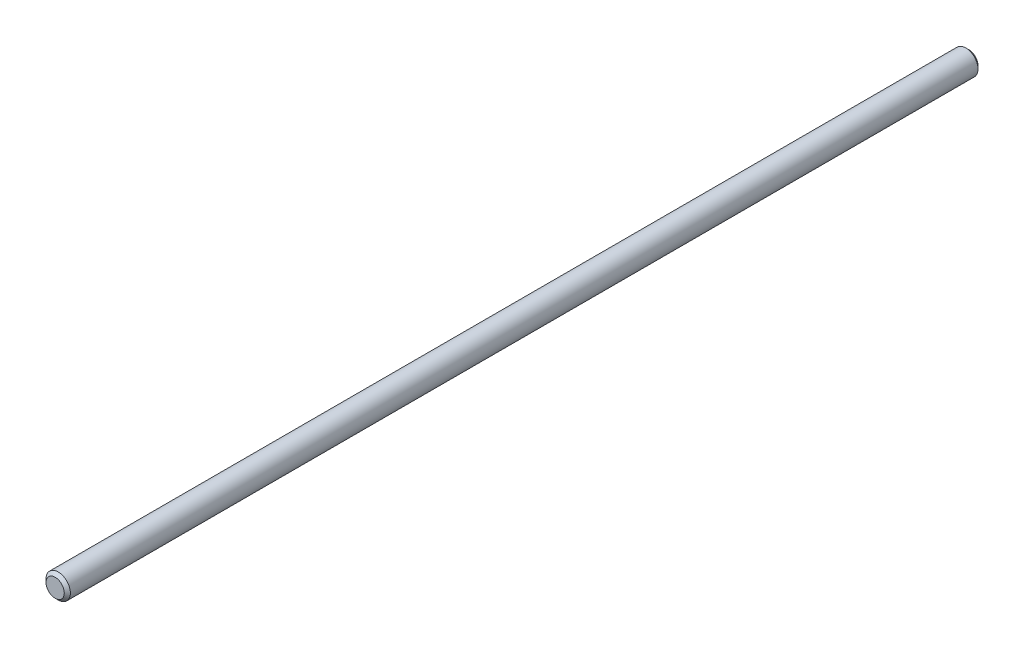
ISO-10303-21;
HEADER;
FILE_DESCRIPTION(('STEP AP214'),'2;1');
FILE_NAME('part.step','',(''),(''),'','','');
FILE_SCHEMA(('AUTOMOTIVE_DESIGN { 1 0 10303 214 1 1 1 1 }'));
ENDSEC;
DATA;
#1=APPLICATION_CONTEXT('core data for automotive mechanical design processes');
#2=APPLICATION_PROTOCOL_DEFINITION('international standard','automotive_design',2000,#1);
#3=PRODUCT_CONTEXT('',#1,'mechanical');
#4=PRODUCT('Part','Part','',(#3));
#5=PRODUCT_RELATED_PRODUCT_CATEGORY('part','',(#4));
#6=PRODUCT_DEFINITION_FORMATION('','',#4);
#7=PRODUCT_DEFINITION_CONTEXT('part definition',#1,'design');
#8=PRODUCT_DEFINITION('design','',#6,#7);
#9=PRODUCT_DEFINITION_SHAPE('','',#8);
#10=(LENGTH_UNIT() NAMED_UNIT(*) SI_UNIT(.MILLI.,.METRE.));
#11=(NAMED_UNIT(*) PLANE_ANGLE_UNIT() SI_UNIT($,.RADIAN.));
#12=(NAMED_UNIT(*) SI_UNIT($,.STERADIAN.) SOLID_ANGLE_UNIT());
#13=UNCERTAINTY_MEASURE_WITH_UNIT(LENGTH_MEASURE(1.E-05),#10,'distance_accuracy_value','');
#14=(GEOMETRIC_REPRESENTATION_CONTEXT(3) GLOBAL_UNCERTAINTY_ASSIGNED_CONTEXT((#13)) GLOBAL_UNIT_ASSIGNED_CONTEXT((#10,
#11,#12)) REPRESENTATION_CONTEXT('',''));
#15=CARTESIAN_POINT('',(0.,0.,0.));
#16=DIRECTION('',(0.,0.,1.));
#17=DIRECTION('',(1.,0.,0.));
#18=AXIS2_PLACEMENT_3D('',#15,#16,#17);
#19=CARTESIAN_POINT('',(0.,0.,-150.));
#20=DIRECTION('',(0.,0.,1.));
#21=DIRECTION('',(1.,0.,0.));
#22=AXIS2_PLACEMENT_3D('',#19,#20,#21);
#23=CYLINDRICAL_SURFACE('',#22,2.);
#24=CARTESIAN_POINT('',(0.,0.,-149.5));
#25=DIRECTION('',(0.,0.,1.));
#26=DIRECTION('',(1.,0.,0.));
#27=AXIS2_PLACEMENT_3D('',#24,#25,#26);
#28=CIRCLE('',#27,2.);
#29=CARTESIAN_POINT('',(2.,0.,-149.5));
#30=VERTEX_POINT('',#29);
#31=EDGE_CURVE('E43',#30,#30,#28,.T.);
#32=ORIENTED_EDGE('',*,*,#31,.T.);
#33=EDGE_LOOP('',(#32));
#34=FACE_BOUND('',#33,.T.);
#35=CARTESIAN_POINT('',(0.,0.,-0.5));
#36=DIRECTION('',(0.,0.,1.));
#37=DIRECTION('',(1.,0.,0.));
#38=AXIS2_PLACEMENT_3D('',#35,#36,#37);
#39=CIRCLE('',#38,2.);
#40=CARTESIAN_POINT('',(2.,0.,-0.5));
#41=VERTEX_POINT('',#40);
#42=EDGE_CURVE('E47',#41,#41,#39,.F.);
#43=ORIENTED_EDGE('',*,*,#42,.T.);
#44=EDGE_LOOP('',(#43));
#45=FACE_BOUND('',#44,.T.);
#46=ADVANCED_FACE('F32',(#34,#45),#23,.T.);
#47=CARTESIAN_POINT('',(0.,0.,-150.));
#48=DIRECTION('',(0.,0.,1.));
#49=DIRECTION('',(1.,0.,0.));
#50=AXIS2_PLACEMENT_3D('',#47,#48,#49);
#51=PLANE('',#50);
#52=CARTESIAN_POINT('',(0.,0.,-150.));
#53=DIRECTION('',(0.,0.,1.));
#54=DIRECTION('',(1.,0.,0.));
#55=AXIS2_PLACEMENT_3D('',#52,#53,#54);
#56=CIRCLE('',#55,1.50000000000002);
#57=CARTESIAN_POINT('',(1.50000000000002,0.,-150.));
#58=VERTEX_POINT('',#57);
#59=EDGE_CURVE('E39',#58,#58,#56,.F.);
#60=ORIENTED_EDGE('',*,*,#59,.T.);
#61=EDGE_LOOP('',(#60));
#62=FACE_BOUND('',#61,.T.);
#63=ADVANCED_FACE('F63',(#62),#51,.F.);
#64=CARTESIAN_POINT('',(0.,0.,0.));
#65=DIRECTION('',(0.,0.,1.));
#66=DIRECTION('',(1.,0.,0.));
#67=AXIS2_PLACEMENT_3D('',#64,#65,#66);
#68=PLANE('',#67);
#69=CARTESIAN_POINT('',(0.,0.,0.));
#70=DIRECTION('',(0.,0.,1.));
#71=DIRECTION('',(1.,0.,0.));
#72=AXIS2_PLACEMENT_3D('',#69,#70,#71);
#73=CIRCLE('',#72,1.49999999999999);
#74=CARTESIAN_POINT('',(1.49999999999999,0.,0.));
#75=VERTEX_POINT('',#74);
#76=EDGE_CURVE('E10',#75,#75,#73,.T.);
#77=ORIENTED_EDGE('',*,*,#76,.T.);
#78=EDGE_LOOP('',(#77));
#79=FACE_BOUND('',#78,.T.);
#80=ADVANCED_FACE('F60',(#79),#68,.T.);
#81=CARTESIAN_POINT('',(0.,0.,-149.5));
#82=DIRECTION('',(0.,0.,1.));
#83=DIRECTION('',(1.,0.,0.));
#84=AXIS2_PLACEMENT_3D('',#81,#82,#83);
#85=CONICAL_SURFACE('',#84,2.,0.78539816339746);
#86=ORIENTED_EDGE('',*,*,#59,.F.);
#87=EDGE_LOOP('',(#86));
#88=FACE_BOUND('',#87,.T.);
#89=ORIENTED_EDGE('',*,*,#31,.F.);
#90=EDGE_LOOP('',(#89));
#91=FACE_BOUND('',#90,.T.);
#92=ADVANCED_FACE('F56',(#88,#91),#85,.T.);
#93=CARTESIAN_POINT('',(0.,0.,0.));
#94=DIRECTION('',(0.,0.,-1.));
#95=DIRECTION('',(-1.,0.,0.));
#96=AXIS2_PLACEMENT_3D('',#93,#94,#95);
#97=CONICAL_SURFACE('',#96,1.49999999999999,0.78539816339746);
#98=ORIENTED_EDGE('',*,*,#42,.F.);
#99=EDGE_LOOP('',(#98));
#100=FACE_BOUND('',#99,.T.);
#101=ORIENTED_EDGE('',*,*,#76,.F.);
#102=EDGE_LOOP('',(#101));
#103=FACE_BOUND('',#102,.T.);
#104=ADVANCED_FACE('F34',(#100,#103),#97,.T.);
#105=CLOSED_SHELL('',(#46,#63,#80,#92,#104));
#106=MANIFOLD_SOLID_BREP('B2',#105);
#107=ADVANCED_BREP_SHAPE_REPRESENTATION('',(#18,#106),#14);
#108=SHAPE_DEFINITION_REPRESENTATION(#9,#107);
ENDSEC;
END-ISO-10303-21;
